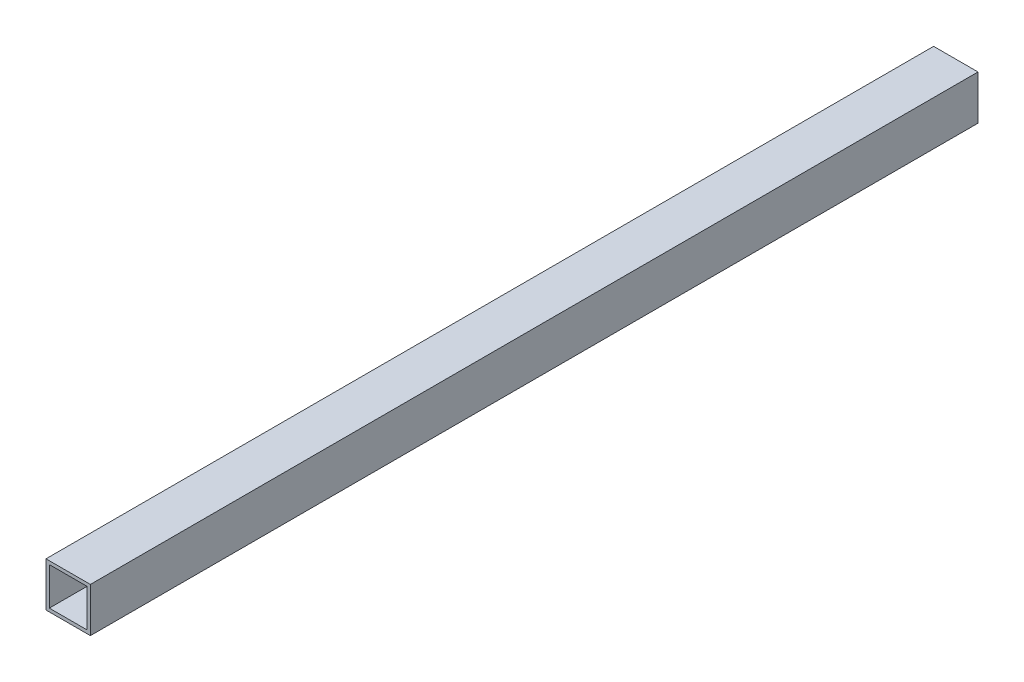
ISO-10303-21;
HEADER;
FILE_DESCRIPTION(('STEP AP214'),'2;1');
FILE_NAME('part.step','',(''),(''),'','','');
FILE_SCHEMA(('AUTOMOTIVE_DESIGN { 1 0 10303 214 1 1 1 1 }'));
ENDSEC;
DATA;
#1=APPLICATION_CONTEXT('core data for automotive mechanical design processes');
#2=APPLICATION_PROTOCOL_DEFINITION('international standard','automotive_design',2000,#1);
#3=PRODUCT_CONTEXT('',#1,'mechanical');
#4=PRODUCT('Part','Part','',(#3));
#5=PRODUCT_RELATED_PRODUCT_CATEGORY('part','',(#4));
#6=PRODUCT_DEFINITION_FORMATION('','',#4);
#7=PRODUCT_DEFINITION_CONTEXT('part definition',#1,'design');
#8=PRODUCT_DEFINITION('design','',#6,#7);
#9=PRODUCT_DEFINITION_SHAPE('','',#8);
#10=(LENGTH_UNIT() NAMED_UNIT(*) SI_UNIT(.MILLI.,.METRE.));
#11=(NAMED_UNIT(*) PLANE_ANGLE_UNIT() SI_UNIT($,.RADIAN.));
#12=(NAMED_UNIT(*) SI_UNIT($,.STERADIAN.) SOLID_ANGLE_UNIT());
#13=UNCERTAINTY_MEASURE_WITH_UNIT(LENGTH_MEASURE(1.E-05),#10,'distance_accuracy_value','');
#14=(GEOMETRIC_REPRESENTATION_CONTEXT(3) GLOBAL_UNCERTAINTY_ASSIGNED_CONTEXT((#13)) GLOBAL_UNIT_ASSIGNED_CONTEXT((#10,
#11,#12)) REPRESENTATION_CONTEXT('',''));
#15=CARTESIAN_POINT('',(0.,0.,0.));
#16=DIRECTION('',(0.,0.,1.));
#17=DIRECTION('',(1.,0.,0.));
#18=AXIS2_PLACEMENT_3D('',#15,#16,#17);
#19=CARTESIAN_POINT('',(0.,0.,800.));
#20=DIRECTION('',(0.,0.,1.));
#21=DIRECTION('',(1.,0.,0.));
#22=AXIS2_PLACEMENT_3D('',#19,#20,#21);
#23=PLANE('',#22);
#24=DIRECTION('',(0.,-1.,0.));
#25=VECTOR('',#24,1.);
#26=CARTESIAN_POINT('',(-17.,17.,800.));
#27=LINE('',#26,#25);
#28=CARTESIAN_POINT('',(-17.,17.,800.));
#29=VERTEX_POINT('',#28);
#30=CARTESIAN_POINT('',(-17.,-17.,800.));
#31=VERTEX_POINT('',#30);
#32=EDGE_CURVE('E25',#29,#31,#27,.T.);
#33=ORIENTED_EDGE('',*,*,#32,.F.);
#34=DIRECTION('',(-1.,0.,0.));
#35=VECTOR('',#34,1.);
#36=CARTESIAN_POINT('',(17.,17.,800.));
#37=LINE('',#36,#35);
#38=CARTESIAN_POINT('',(17.,17.,800.));
#39=VERTEX_POINT('',#38);
#40=EDGE_CURVE('E92',#39,#29,#37,.T.);
#41=ORIENTED_EDGE('',*,*,#40,.F.);
#42=DIRECTION('',(0.,1.,0.));
#43=VECTOR('',#42,1.);
#44=CARTESIAN_POINT('',(17.,-17.,800.));
#45=LINE('',#44,#43);
#46=CARTESIAN_POINT('',(17.,-17.,800.));
#47=VERTEX_POINT('',#46);
#48=EDGE_CURVE('E121',#47,#39,#45,.T.);
#49=ORIENTED_EDGE('',*,*,#48,.F.);
#50=DIRECTION('',(1.,0.,0.));
#51=VECTOR('',#50,1.);
#52=CARTESIAN_POINT('',(-17.,-17.,800.));
#53=LINE('',#52,#51);
#54=EDGE_CURVE('E139',#31,#47,#53,.T.);
#55=ORIENTED_EDGE('',*,*,#54,.F.);
#56=EDGE_LOOP('',(#33,#41,#49,#55));
#57=FACE_BOUND('',#56,.T.);
#58=DIRECTION('',(1.,0.,0.));
#59=VECTOR('',#58,1.);
#60=CARTESIAN_POINT('',(-20.,-20.,800.));
#61=LINE('',#60,#59);
#62=CARTESIAN_POINT('',(-20.,-20.,800.));
#63=VERTEX_POINT('',#62);
#64=CARTESIAN_POINT('',(20.,-20.,800.));
#65=VERTEX_POINT('',#64);
#66=EDGE_CURVE('E198',#63,#65,#61,.T.);
#67=ORIENTED_EDGE('',*,*,#66,.T.);
#68=DIRECTION('',(0.,1.,0.));
#69=VECTOR('',#68,1.);
#70=CARTESIAN_POINT('',(20.,-20.,800.));
#71=LINE('',#70,#69);
#72=CARTESIAN_POINT('',(20.,20.,800.));
#73=VERTEX_POINT('',#72);
#74=EDGE_CURVE('E185',#65,#73,#71,.T.);
#75=ORIENTED_EDGE('',*,*,#74,.T.);
#76=DIRECTION('',(-1.,0.,0.));
#77=VECTOR('',#76,1.);
#78=CARTESIAN_POINT('',(20.,20.,800.));
#79=LINE('',#78,#77);
#80=CARTESIAN_POINT('',(-20.,20.,800.));
#81=VERTEX_POINT('',#80);
#82=EDGE_CURVE('E157',#73,#81,#79,.T.);
#83=ORIENTED_EDGE('',*,*,#82,.T.);
#84=DIRECTION('',(0.,-1.,0.));
#85=VECTOR('',#84,1.);
#86=CARTESIAN_POINT('',(-20.,20.,800.));
#87=LINE('',#86,#85);
#88=EDGE_CURVE('E147',#81,#63,#87,.T.);
#89=ORIENTED_EDGE('',*,*,#88,.T.);
#90=EDGE_LOOP('',(#67,#75,#83,#89));
#91=FACE_BOUND('',#90,.T.);
#92=ADVANCED_FACE('F16',(#57,#91),#23,.T.);
#93=CARTESIAN_POINT('',(0.,0.,0.));
#94=DIRECTION('',(0.,0.,1.));
#95=DIRECTION('',(1.,0.,0.));
#96=AXIS2_PLACEMENT_3D('',#93,#94,#95);
#97=PLANE('',#96);
#98=DIRECTION('',(1.,0.,0.));
#99=VECTOR('',#98,1.);
#100=CARTESIAN_POINT('',(-17.,-17.,0.));
#101=LINE('',#100,#99);
#102=CARTESIAN_POINT('',(-17.,-17.,0.));
#103=VERTEX_POINT('',#102);
#104=CARTESIAN_POINT('',(17.,-17.,0.));
#105=VERTEX_POINT('',#104);
#106=EDGE_CURVE('E114',#103,#105,#101,.T.);
#107=ORIENTED_EDGE('',*,*,#106,.T.);
#108=DIRECTION('',(0.,1.,0.));
#109=VECTOR('',#108,1.);
#110=CARTESIAN_POINT('',(17.,-17.,0.));
#111=LINE('',#110,#109);
#112=CARTESIAN_POINT('',(17.,17.,0.));
#113=VERTEX_POINT('',#112);
#114=EDGE_CURVE('E110',#105,#113,#111,.T.);
#115=ORIENTED_EDGE('',*,*,#114,.T.);
#116=DIRECTION('',(-1.,0.,0.));
#117=VECTOR('',#116,1.);
#118=CARTESIAN_POINT('',(17.,17.,0.));
#119=LINE('',#118,#117);
#120=CARTESIAN_POINT('',(-17.,17.,0.));
#121=VERTEX_POINT('',#120);
#122=EDGE_CURVE('E99',#113,#121,#119,.T.);
#123=ORIENTED_EDGE('',*,*,#122,.T.);
#124=DIRECTION('',(0.,-1.,0.));
#125=VECTOR('',#124,1.);
#126=CARTESIAN_POINT('',(-17.,17.,0.));
#127=LINE('',#126,#125);
#128=EDGE_CURVE('E10',#121,#103,#127,.T.);
#129=ORIENTED_EDGE('',*,*,#128,.T.);
#130=EDGE_LOOP('',(#107,#115,#123,#129));
#131=FACE_BOUND('',#130,.T.);
#132=DIRECTION('',(0.,-1.,0.));
#133=VECTOR('',#132,1.);
#134=CARTESIAN_POINT('',(-20.,20.,0.));
#135=LINE('',#134,#133);
#136=CARTESIAN_POINT('',(-20.,20.,0.));
#137=VERTEX_POINT('',#136);
#138=CARTESIAN_POINT('',(-20.,-20.,0.));
#139=VERTEX_POINT('',#138);
#140=EDGE_CURVE('E153',#137,#139,#135,.T.);
#141=ORIENTED_EDGE('',*,*,#140,.F.);
#142=DIRECTION('',(-1.,0.,0.));
#143=VECTOR('',#142,1.);
#144=CARTESIAN_POINT('',(20.,20.,0.));
#145=LINE('',#144,#143);
#146=CARTESIAN_POINT('',(20.,20.,0.));
#147=VERTEX_POINT('',#146);
#148=EDGE_CURVE('E180',#147,#137,#145,.T.);
#149=ORIENTED_EDGE('',*,*,#148,.F.);
#150=DIRECTION('',(0.,1.,0.));
#151=VECTOR('',#150,1.);
#152=CARTESIAN_POINT('',(20.,-20.,0.));
#153=LINE('',#152,#151);
#154=CARTESIAN_POINT('',(20.,-20.,0.));
#155=VERTEX_POINT('',#154);
#156=EDGE_CURVE('E194',#155,#147,#153,.T.);
#157=ORIENTED_EDGE('',*,*,#156,.F.);
#158=DIRECTION('',(1.,0.,0.));
#159=VECTOR('',#158,1.);
#160=CARTESIAN_POINT('',(-20.,-20.,0.));
#161=LINE('',#160,#159);
#162=EDGE_CURVE('E206',#139,#155,#161,.T.);
#163=ORIENTED_EDGE('',*,*,#162,.F.);
#164=EDGE_LOOP('',(#141,#149,#157,#163));
#165=FACE_BOUND('',#164,.T.);
#166=ADVANCED_FACE('F111',(#131,#165),#97,.F.);
#167=CARTESIAN_POINT('',(-17.,17.,0.));
#168=DIRECTION('',(1.,0.,0.));
#169=DIRECTION('',(0.,1.,0.));
#170=AXIS2_PLACEMENT_3D('',#167,#168,#169);
#171=PLANE('',#170);
#172=DIRECTION('',(0.,0.,1.));
#173=VECTOR('',#172,1.);
#174=CARTESIAN_POINT('',(-17.,17.,0.));
#175=LINE('',#174,#173);
#176=EDGE_CURVE('E105',#121,#29,#175,.T.);
#177=ORIENTED_EDGE('',*,*,#176,.T.);
#178=ORIENTED_EDGE('',*,*,#32,.T.);
#179=DIRECTION('',(0.,0.,1.));
#180=VECTOR('',#179,1.);
#181=CARTESIAN_POINT('',(-17.,-17.,0.));
#182=LINE('',#181,#180);
#183=EDGE_CURVE('E137',#103,#31,#182,.T.);
#184=ORIENTED_EDGE('',*,*,#183,.F.);
#185=ORIENTED_EDGE('',*,*,#128,.F.);
#186=EDGE_LOOP('',(#177,#178,#184,#185));
#187=FACE_BOUND('',#186,.T.);
#188=ADVANCED_FACE('F135',(#187),#171,.T.);
#189=CARTESIAN_POINT('',(17.,17.,0.));
#190=DIRECTION('',(0.,-1.,0.));
#191=DIRECTION('',(0.,0.,-1.));
#192=AXIS2_PLACEMENT_3D('',#189,#190,#191);
#193=PLANE('',#192);
#194=DIRECTION('',(0.,0.,1.));
#195=VECTOR('',#194,1.);
#196=CARTESIAN_POINT('',(17.,17.,0.));
#197=LINE('',#196,#195);
#198=EDGE_CURVE('E103',#113,#39,#197,.T.);
#199=ORIENTED_EDGE('',*,*,#198,.T.);
#200=ORIENTED_EDGE('',*,*,#40,.T.);
#201=ORIENTED_EDGE('',*,*,#176,.F.);
#202=ORIENTED_EDGE('',*,*,#122,.F.);
#203=EDGE_LOOP('',(#199,#200,#201,#202));
#204=FACE_BOUND('',#203,.T.);
#205=ADVANCED_FACE('F101',(#204),#193,.T.);
#206=CARTESIAN_POINT('',(17.,-17.,0.));
#207=DIRECTION('',(-1.,0.,0.));
#208=DIRECTION('',(0.,0.,1.));
#209=AXIS2_PLACEMENT_3D('',#206,#207,#208);
#210=PLANE('',#209);
#211=DIRECTION('',(0.,0.,1.));
#212=VECTOR('',#211,1.);
#213=CARTESIAN_POINT('',(17.,-17.,0.));
#214=LINE('',#213,#212);
#215=EDGE_CURVE('E143',#105,#47,#214,.T.);
#216=ORIENTED_EDGE('',*,*,#215,.T.);
#217=ORIENTED_EDGE('',*,*,#48,.T.);
#218=ORIENTED_EDGE('',*,*,#198,.F.);
#219=ORIENTED_EDGE('',*,*,#114,.F.);
#220=EDGE_LOOP('',(#216,#217,#218,#219));
#221=FACE_BOUND('',#220,.T.);
#222=ADVANCED_FACE('F120',(#221),#210,.T.);
#223=CARTESIAN_POINT('',(-17.,-17.,0.));
#224=DIRECTION('',(0.,1.,0.));
#225=DIRECTION('',(1.,0.,0.));
#226=AXIS2_PLACEMENT_3D('',#223,#224,#225);
#227=PLANE('',#226);
#228=ORIENTED_EDGE('',*,*,#183,.T.);
#229=ORIENTED_EDGE('',*,*,#54,.T.);
#230=ORIENTED_EDGE('',*,*,#215,.F.);
#231=ORIENTED_EDGE('',*,*,#106,.F.);
#232=EDGE_LOOP('',(#228,#229,#230,#231));
#233=FACE_BOUND('',#232,.T.);
#234=ADVANCED_FACE('F145',(#233),#227,.T.);
#235=CARTESIAN_POINT('',(-20.,20.,0.));
#236=DIRECTION('',(1.,0.,0.));
#237=DIRECTION('',(0.,1.,0.));
#238=AXIS2_PLACEMENT_3D('',#235,#236,#237);
#239=PLANE('',#238);
#240=ORIENTED_EDGE('',*,*,#140,.T.);
#241=DIRECTION('',(0.,0.,1.));
#242=VECTOR('',#241,1.);
#243=CARTESIAN_POINT('',(-20.,-20.,0.));
#244=LINE('',#243,#242);
#245=EDGE_CURVE('E195',#139,#63,#244,.T.);
#246=ORIENTED_EDGE('',*,*,#245,.T.);
#247=ORIENTED_EDGE('',*,*,#88,.F.);
#248=DIRECTION('',(0.,0.,1.));
#249=VECTOR('',#248,1.);
#250=CARTESIAN_POINT('',(-20.,20.,0.));
#251=LINE('',#250,#249);
#252=EDGE_CURVE('E175',#137,#81,#251,.T.);
#253=ORIENTED_EDGE('',*,*,#252,.F.);
#254=EDGE_LOOP('',(#240,#246,#247,#253));
#255=FACE_BOUND('',#254,.T.);
#256=ADVANCED_FACE('F222',(#255),#239,.F.);
#257=CARTESIAN_POINT('',(20.,20.,0.));
#258=DIRECTION('',(0.,-1.,0.));
#259=DIRECTION('',(0.,0.,-1.));
#260=AXIS2_PLACEMENT_3D('',#257,#258,#259);
#261=PLANE('',#260);
#262=ORIENTED_EDGE('',*,*,#148,.T.);
#263=ORIENTED_EDGE('',*,*,#252,.T.);
#264=ORIENTED_EDGE('',*,*,#82,.F.);
#265=DIRECTION('',(0.,0.,1.));
#266=VECTOR('',#265,1.);
#267=CARTESIAN_POINT('',(20.,20.,0.));
#268=LINE('',#267,#266);
#269=EDGE_CURVE('E190',#147,#73,#268,.T.);
#270=ORIENTED_EDGE('',*,*,#269,.F.);
#271=EDGE_LOOP('',(#262,#263,#264,#270));
#272=FACE_BOUND('',#271,.T.);
#273=ADVANCED_FACE('F218',(#272),#261,.F.);
#274=CARTESIAN_POINT('',(20.,-20.,0.));
#275=DIRECTION('',(-1.,0.,0.));
#276=DIRECTION('',(0.,0.,1.));
#277=AXIS2_PLACEMENT_3D('',#274,#275,#276);
#278=PLANE('',#277);
#279=ORIENTED_EDGE('',*,*,#156,.T.);
#280=ORIENTED_EDGE('',*,*,#269,.T.);
#281=ORIENTED_EDGE('',*,*,#74,.F.);
#282=DIRECTION('',(0.,0.,1.));
#283=VECTOR('',#282,1.);
#284=CARTESIAN_POINT('',(20.,-20.,0.));
#285=LINE('',#284,#283);
#286=EDGE_CURVE('E202',#155,#65,#285,.T.);
#287=ORIENTED_EDGE('',*,*,#286,.F.);
#288=EDGE_LOOP('',(#279,#280,#281,#287));
#289=FACE_BOUND('',#288,.T.);
#290=ADVANCED_FACE('F215',(#289),#278,.F.);
#291=CARTESIAN_POINT('',(-20.,-20.,0.));
#292=DIRECTION('',(0.,1.,0.));
#293=DIRECTION('',(1.,0.,0.));
#294=AXIS2_PLACEMENT_3D('',#291,#292,#293);
#295=PLANE('',#294);
#296=ORIENTED_EDGE('',*,*,#162,.T.);
#297=ORIENTED_EDGE('',*,*,#286,.T.);
#298=ORIENTED_EDGE('',*,*,#66,.F.);
#299=ORIENTED_EDGE('',*,*,#245,.F.);
#300=EDGE_LOOP('',(#296,#297,#298,#299));
#301=FACE_BOUND('',#300,.T.);
#302=ADVANCED_FACE('F221',(#301),#295,.F.);
#303=CLOSED_SHELL('',(#92,#166,#188,#205,#222,#234,#256,#273,#290,#302));
#304=MANIFOLD_SOLID_BREP('B1',#303);
#305=ADVANCED_BREP_SHAPE_REPRESENTATION('',(#18,#304),#14);
#306=SHAPE_DEFINITION_REPRESENTATION(#9,#305);
ENDSEC;
END-ISO-10303-21;
